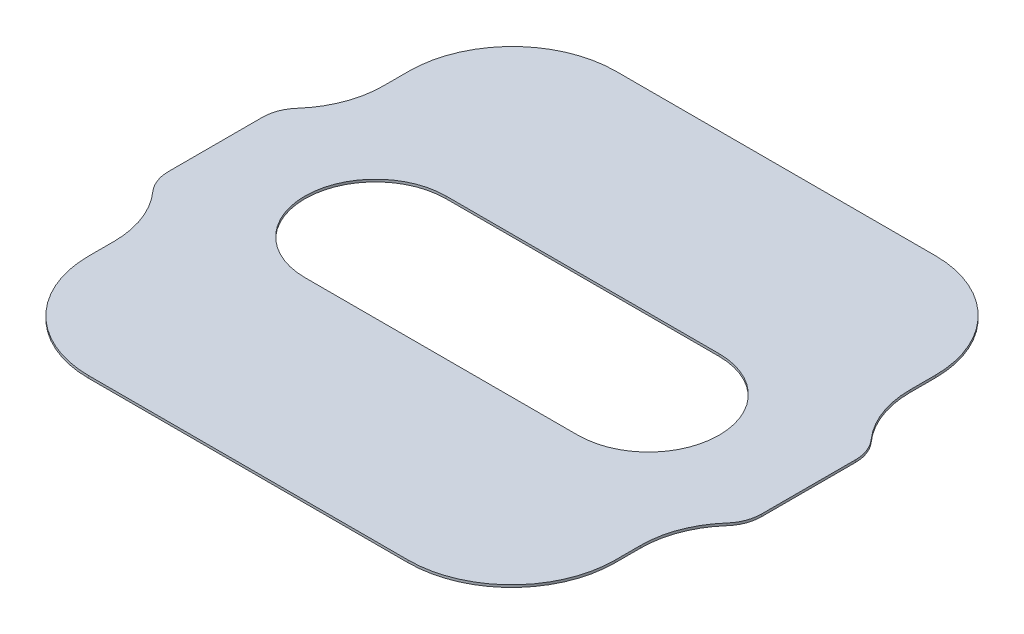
ISO-10303-21;
HEADER;
FILE_DESCRIPTION(('STEP AP214'),'2;1');
FILE_NAME('part.step','',(''),(''),'','','');
FILE_SCHEMA(('AUTOMOTIVE_DESIGN { 1 0 10303 214 1 1 1 1 }'));
ENDSEC;
DATA;
#1=APPLICATION_CONTEXT('core data for automotive mechanical design processes');
#2=APPLICATION_PROTOCOL_DEFINITION('international standard','automotive_design',2000,#1);
#3=PRODUCT_CONTEXT('',#1,'mechanical');
#4=PRODUCT('Part','Part','',(#3));
#5=PRODUCT_RELATED_PRODUCT_CATEGORY('part','',(#4));
#6=PRODUCT_DEFINITION_FORMATION('','',#4);
#7=PRODUCT_DEFINITION_CONTEXT('part definition',#1,'design');
#8=PRODUCT_DEFINITION('design','',#6,#7);
#9=PRODUCT_DEFINITION_SHAPE('','',#8);
#10=(LENGTH_UNIT() NAMED_UNIT(*) SI_UNIT(.MILLI.,.METRE.));
#11=(NAMED_UNIT(*) PLANE_ANGLE_UNIT() SI_UNIT($,.RADIAN.));
#12=(NAMED_UNIT(*) SI_UNIT($,.STERADIAN.) SOLID_ANGLE_UNIT());
#13=UNCERTAINTY_MEASURE_WITH_UNIT(LENGTH_MEASURE(1.E-05),#10,'distance_accuracy_value','');
#14=(GEOMETRIC_REPRESENTATION_CONTEXT(3) GLOBAL_UNCERTAINTY_ASSIGNED_CONTEXT((#13)) GLOBAL_UNIT_ASSIGNED_CONTEXT((#10,
#11,#12)) REPRESENTATION_CONTEXT('',''));
#15=CARTESIAN_POINT('',(0.,0.,0.));
#16=DIRECTION('',(0.,0.,1.));
#17=DIRECTION('',(1.,0.,0.));
#18=AXIS2_PLACEMENT_3D('',#15,#16,#17);
#19=CARTESIAN_POINT('',(16.1952754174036,0.0254,5.33075165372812));
#20=DIRECTION('',(0.,-1.,0.));
#21=DIRECTION('',(0.,0.,-1.));
#22=AXIS2_PLACEMENT_3D('',#19,#20,#21);
#23=CYLINDRICAL_SURFACE('',#22,0.400000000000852);
#24=CARTESIAN_POINT('',(16.1952754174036,0.,5.33075165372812));
#25=DIRECTION('',(0.,1.,0.));
#26=DIRECTION('',(0.,0.,1.));
#27=AXIS2_PLACEMENT_3D('',#24,#25,#26);
#28=CIRCLE('',#27,0.400000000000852);
#29=CARTESIAN_POINT('',(15.8963417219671,0.,5.06497233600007));
#30=VERTEX_POINT('',#29);
#31=CARTESIAN_POINT('',(15.7952754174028,0.,5.33075165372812));
#32=VERTEX_POINT('',#31);
#33=EDGE_CURVE('E230',#30,#32,#28,.T.);
#34=ORIENTED_EDGE('',*,*,#33,.T.);
#35=DIRECTION('',(0.,-1.,0.));
#36=VECTOR('',#35,1.);
#37=CARTESIAN_POINT('',(15.7952754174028,0.0254,5.33075165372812));
#38=LINE('',#37,#36);
#39=CARTESIAN_POINT('',(15.7952754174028,0.0254,5.33075165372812));
#40=VERTEX_POINT('',#39);
#41=EDGE_CURVE('E11',#40,#32,#38,.T.);
#42=ORIENTED_EDGE('',*,*,#41,.F.);
#43=CARTESIAN_POINT('',(16.1952754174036,0.0254,5.33075165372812));
#44=DIRECTION('',(0.,1.,0.));
#45=DIRECTION('',(0.,0.,1.));
#46=AXIS2_PLACEMENT_3D('',#43,#44,#45);
#47=CIRCLE('',#46,0.400000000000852);
#48=CARTESIAN_POINT('',(15.8963417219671,0.0254,5.06497233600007));
#49=VERTEX_POINT('',#48);
#50=EDGE_CURVE('E234',#49,#40,#47,.T.);
#51=ORIENTED_EDGE('',*,*,#50,.F.);
#52=DIRECTION('',(0.,-1.,0.));
#53=VECTOR('',#52,1.);
#54=CARTESIAN_POINT('',(15.8963417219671,0.0254,5.06497233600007));
#55=LINE('',#54,#53);
#56=EDGE_CURVE('E276',#49,#30,#55,.T.);
#57=ORIENTED_EDGE('',*,*,#56,.T.);
#58=EDGE_LOOP('',(#34,#42,#51,#57));
#59=FACE_BOUND('',#58,.T.);
#60=ADVANCED_FACE('F37',(#59),#23,.T.);
#61=CARTESIAN_POINT('',(15.7952754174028,0.0254,5.33075165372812));
#62=DIRECTION('',(1.,0.,0.));
#63=DIRECTION('',(0.,0.,-1.));
#64=AXIS2_PLACEMENT_3D('',#61,#62,#63);
#65=PLANE('',#64);
#66=DIRECTION('',(0.,0.,1.));
#67=VECTOR('',#66,1.);
#68=CARTESIAN_POINT('',(15.7952754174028,0.,5.33075165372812));
#69=LINE('',#68,#67);
#70=CARTESIAN_POINT('',(15.7952754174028,0.,6.33075165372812));
#71=VERTEX_POINT('',#70);
#72=EDGE_CURVE('E279',#32,#71,#69,.T.);
#73=ORIENTED_EDGE('',*,*,#72,.T.);
#74=DIRECTION('',(0.,-1.,0.));
#75=VECTOR('',#74,1.);
#76=CARTESIAN_POINT('',(15.7952754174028,0.0254,6.33075165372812));
#77=LINE('',#76,#75);
#78=CARTESIAN_POINT('',(15.7952754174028,0.0254,6.33075165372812));
#79=VERTEX_POINT('',#78);
#80=EDGE_CURVE('E44',#79,#71,#77,.T.);
#81=ORIENTED_EDGE('',*,*,#80,.F.);
#82=DIRECTION('',(0.,0.,1.));
#83=VECTOR('',#82,1.);
#84=CARTESIAN_POINT('',(15.7952754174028,0.0254,5.33075165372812));
#85=LINE('',#84,#83);
#86=EDGE_CURVE('E237',#40,#79,#85,.T.);
#87=ORIENTED_EDGE('',*,*,#86,.F.);
#88=ORIENTED_EDGE('',*,*,#41,.T.);
#89=EDGE_LOOP('',(#73,#81,#87,#88));
#90=FACE_BOUND('',#89,.T.);
#91=ADVANCED_FACE('F394',(#90),#65,.F.);
#92=CARTESIAN_POINT('',(16.1952754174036,0.0254,6.33075165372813));
#93=DIRECTION('',(0.,-1.,0.));
#94=DIRECTION('',(0.,0.,-1.));
#95=AXIS2_PLACEMENT_3D('',#92,#93,#94);
#96=CYLINDRICAL_SURFACE('',#95,0.400000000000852);
#97=CARTESIAN_POINT('',(16.1952754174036,0.,6.33075165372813));
#98=DIRECTION('',(0.,1.,0.));
#99=DIRECTION('',(0.,0.,-1.));
#100=AXIS2_PLACEMENT_3D('',#97,#98,#99);
#101=CIRCLE('',#100,0.400000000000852);
#102=CARTESIAN_POINT('',(15.8963417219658,0.,6.59653097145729));
#103=VERTEX_POINT('',#102);
#104=EDGE_CURVE('E281',#71,#103,#101,.T.);
#105=ORIENTED_EDGE('',*,*,#104,.T.);
#106=DIRECTION('',(0.,-1.,0.));
#107=VECTOR('',#106,1.);
#108=CARTESIAN_POINT('',(15.8963417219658,0.0254,6.59653097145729));
#109=LINE('',#108,#107);
#110=CARTESIAN_POINT('',(15.8963417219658,0.0254,6.59653097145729));
#111=VERTEX_POINT('',#110);
#112=EDGE_CURVE('E366',#111,#103,#109,.T.);
#113=ORIENTED_EDGE('',*,*,#112,.F.);
#114=CARTESIAN_POINT('',(16.1952754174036,0.0254,6.33075165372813));
#115=DIRECTION('',(0.,1.,0.));
#116=DIRECTION('',(0.,0.,-1.));
#117=AXIS2_PLACEMENT_3D('',#114,#115,#116);
#118=CIRCLE('',#117,0.400000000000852);
#119=EDGE_CURVE('E240',#79,#111,#118,.T.);
#120=ORIENTED_EDGE('',*,*,#119,.F.);
#121=ORIENTED_EDGE('',*,*,#80,.T.);
#122=EDGE_LOOP('',(#105,#113,#120,#121));
#123=FACE_BOUND('',#122,.T.);
#124=ADVANCED_FACE('F373',(#123),#96,.T.);
#125=CARTESIAN_POINT('',(15.149007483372,0.0254,7.2609792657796));
#126=DIRECTION('',(0.,-1.,0.));
#127=DIRECTION('',(0.,0.,-1.));
#128=AXIS2_PLACEMENT_3D('',#125,#126,#127);
#129=CYLINDRICAL_SURFACE('',#128,1.00000000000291);
#130=CARTESIAN_POINT('',(15.149007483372,0.,7.2609792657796));
#131=DIRECTION('',(0.,-1.,0.));
#132=DIRECTION('',(0.,0.,1.));
#133=AXIS2_PLACEMENT_3D('',#130,#131,#132);
#134=CIRCLE('',#133,1.00000000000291);
#135=CARTESIAN_POINT('',(16.1490074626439,0.,7.26077564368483));
#136=VERTEX_POINT('',#135);
#137=EDGE_CURVE('E283',#103,#136,#134,.T.);
#138=ORIENTED_EDGE('',*,*,#137,.T.);
#139=DIRECTION('',(0.,-1.,0.));
#140=VECTOR('',#139,1.);
#141=CARTESIAN_POINT('',(16.1490074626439,0.0254,7.26077564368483));
#142=LINE('',#141,#140);
#143=CARTESIAN_POINT('',(16.1490074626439,0.0254,7.26077564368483));
#144=VERTEX_POINT('',#143);
#145=EDGE_CURVE('E363',#144,#136,#142,.T.);
#146=ORIENTED_EDGE('',*,*,#145,.F.);
#147=CARTESIAN_POINT('',(15.149007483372,0.0254,7.2609792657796));
#148=DIRECTION('',(0.,-1.,0.));
#149=DIRECTION('',(0.,0.,1.));
#150=AXIS2_PLACEMENT_3D('',#147,#148,#149);
#151=CIRCLE('',#150,1.00000000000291);
#152=EDGE_CURVE('E242',#111,#144,#151,.T.);
#153=ORIENTED_EDGE('',*,*,#152,.F.);
#154=ORIENTED_EDGE('',*,*,#112,.T.);
#155=EDGE_LOOP('',(#138,#146,#153,#154));
#156=FACE_BOUND('',#155,.T.);
#157=ADVANCED_FACE('F382',(#156),#129,.F.);
#158=CARTESIAN_POINT('',(16.1490624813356,0.0254,7.53097563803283));
#159=DIRECTION('',(0.999999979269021,0.,-0.00020362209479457));
#160=DIRECTION('',(-0.00020362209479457,0.,-0.999999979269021));
#161=AXIS2_PLACEMENT_3D('',#158,#159,#160);
#162=PLANE('',#161);
#163=DIRECTION('',(0.00020362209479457,0.,0.999999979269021));
#164=VECTOR('',#163,1.);
#165=CARTESIAN_POINT('',(16.1490624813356,0.,7.53097563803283));
#166=LINE('',#165,#164);
#167=CARTESIAN_POINT('',(16.1490624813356,0.,7.53097563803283));
#168=VERTEX_POINT('',#167);
#169=EDGE_CURVE('E285',#136,#168,#166,.T.);
#170=ORIENTED_EDGE('',*,*,#169,.T.);
#171=DIRECTION('',(0.,-1.,0.));
#172=VECTOR('',#171,1.);
#173=CARTESIAN_POINT('',(16.1490624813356,0.0254,7.53097563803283));
#174=LINE('',#173,#172);
#175=CARTESIAN_POINT('',(16.1490624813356,0.0254,7.53097563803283));
#176=VERTEX_POINT('',#175);
#177=EDGE_CURVE('E360',#176,#168,#174,.T.);
#178=ORIENTED_EDGE('',*,*,#177,.F.);
#179=DIRECTION('',(0.00020362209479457,0.,0.999999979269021));
#180=VECTOR('',#179,1.);
#181=CARTESIAN_POINT('',(16.1490624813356,0.0254,7.53097563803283));
#182=LINE('',#181,#180);
#183=EDGE_CURVE('E244',#144,#176,#182,.T.);
#184=ORIENTED_EDGE('',*,*,#183,.F.);
#185=ORIENTED_EDGE('',*,*,#145,.T.);
#186=EDGE_LOOP('',(#170,#178,#184,#185));
#187=FACE_BOUND('',#186,.T.);
#188=ADVANCED_FACE('F386',(#187),#162,.F.);
#189=CARTESIAN_POINT('',(17.2490624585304,0.0254,7.53075165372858));
#190=DIRECTION('',(0.,-1.,0.));
#191=DIRECTION('',(0.,0.,-1.));
#192=AXIS2_PLACEMENT_3D('',#189,#190,#191);
#193=CYLINDRICAL_SURFACE('',#192,1.10000000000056);
#194=CARTESIAN_POINT('',(17.2490624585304,0.,7.53075165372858));
#195=DIRECTION('',(0.,1.,0.));
#196=DIRECTION('',(0.,0.,-1.));
#197=AXIS2_PLACEMENT_3D('',#194,#195,#196);
#198=CIRCLE('',#197,1.10000000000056);
#199=CARTESIAN_POINT('',(17.2490624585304,0.,8.63075165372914));
#200=VERTEX_POINT('',#199);
#201=EDGE_CURVE('E287',#168,#200,#198,.T.);
#202=ORIENTED_EDGE('',*,*,#201,.T.);
#203=DIRECTION('',(0.,-1.,0.));
#204=VECTOR('',#203,1.);
#205=CARTESIAN_POINT('',(17.2490624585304,0.0254,8.63075165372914));
#206=LINE('',#205,#204);
#207=CARTESIAN_POINT('',(17.2490624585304,0.0254,8.63075165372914));
#208=VERTEX_POINT('',#207);
#209=EDGE_CURVE('E357',#208,#200,#206,.T.);
#210=ORIENTED_EDGE('',*,*,#209,.F.);
#211=CARTESIAN_POINT('',(17.2490624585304,0.0254,7.53075165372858));
#212=DIRECTION('',(0.,1.,0.));
#213=DIRECTION('',(0.,0.,-1.));
#214=AXIS2_PLACEMENT_3D('',#211,#212,#213);
#215=CIRCLE('',#214,1.10000000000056);
#216=EDGE_CURVE('E246',#176,#208,#215,.T.);
#217=ORIENTED_EDGE('',*,*,#216,.F.);
#218=ORIENTED_EDGE('',*,*,#177,.T.);
#219=EDGE_LOOP('',(#202,#210,#217,#218));
#220=FACE_BOUND('',#219,.T.);
#221=ADVANCED_FACE('F467',(#220),#193,.T.);
#222=CARTESIAN_POINT('',(20.6414883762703,0.0254,8.63075165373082));
#223=DIRECTION('',(0.,0.,-1.));
#224=DIRECTION('',(-1.,0.,0.));
#225=AXIS2_PLACEMENT_3D('',#222,#223,#224);
#226=PLANE('',#225);
#227=DIRECTION('',(1.,0.,0.));
#228=VECTOR('',#227,1.);
#229=CARTESIAN_POINT('',(20.6414883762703,0.,8.63075165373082));
#230=LINE('',#229,#228);
#231=CARTESIAN_POINT('',(20.6414883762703,0.,8.63075165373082));
#232=VERTEX_POINT('',#231);
#233=EDGE_CURVE('E289',#200,#232,#230,.T.);
#234=ORIENTED_EDGE('',*,*,#233,.T.);
#235=DIRECTION('',(0.,-1.,0.));
#236=VECTOR('',#235,1.);
#237=CARTESIAN_POINT('',(20.6414883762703,0.0254,8.63075165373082));
#238=LINE('',#237,#236);
#239=CARTESIAN_POINT('',(20.6414883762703,0.0254,8.63075165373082));
#240=VERTEX_POINT('',#239);
#241=EDGE_CURVE('E354',#240,#232,#238,.T.);
#242=ORIENTED_EDGE('',*,*,#241,.F.);
#243=DIRECTION('',(1.,0.,0.));
#244=VECTOR('',#243,1.);
#245=CARTESIAN_POINT('',(20.6414883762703,0.0254,8.63075165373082));
#246=LINE('',#245,#244);
#247=EDGE_CURVE('E248',#208,#240,#246,.T.);
#248=ORIENTED_EDGE('',*,*,#247,.F.);
#249=ORIENTED_EDGE('',*,*,#209,.T.);
#250=EDGE_LOOP('',(#234,#242,#248,#249));
#251=FACE_BOUND('',#250,.T.);
#252=ADVANCED_FACE('F465',(#251),#226,.F.);
#253=CARTESIAN_POINT('',(20.6414883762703,0.0254,7.53075165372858));
#254=DIRECTION('',(0.,-1.,0.));
#255=DIRECTION('',(0.,0.,-1.));
#256=AXIS2_PLACEMENT_3D('',#253,#254,#255);
#257=CYLINDRICAL_SURFACE('',#256,1.10000000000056);
#258=CARTESIAN_POINT('',(20.6414883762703,0.,7.53075165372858));
#259=DIRECTION('',(0.,1.,0.));
#260=DIRECTION('',(0.,0.,1.));
#261=AXIS2_PLACEMENT_3D('',#258,#259,#260);
#262=CIRCLE('',#261,1.10000000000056);
#263=CARTESIAN_POINT('',(21.7414883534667,0.,7.53097563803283));
#264=VERTEX_POINT('',#263);
#265=EDGE_CURVE('E291',#232,#264,#262,.T.);
#266=ORIENTED_EDGE('',*,*,#265,.T.);
#267=DIRECTION('',(0.,-1.,0.));
#268=VECTOR('',#267,1.);
#269=CARTESIAN_POINT('',(21.7414883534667,0.0254,7.53097563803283));
#270=LINE('',#269,#268);
#271=CARTESIAN_POINT('',(21.7414883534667,0.0254,7.53097563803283));
#272=VERTEX_POINT('',#271);
#273=EDGE_CURVE('E351',#272,#264,#270,.T.);
#274=ORIENTED_EDGE('',*,*,#273,.F.);
#275=CARTESIAN_POINT('',(20.6414883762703,0.0254,7.53075165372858));
#276=DIRECTION('',(0.,1.,0.));
#277=DIRECTION('',(0.,0.,1.));
#278=AXIS2_PLACEMENT_3D('',#275,#276,#277);
#279=CIRCLE('',#278,1.10000000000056);
#280=EDGE_CURVE('E250',#240,#272,#279,.T.);
#281=ORIENTED_EDGE('',*,*,#280,.F.);
#282=ORIENTED_EDGE('',*,*,#241,.T.);
#283=EDGE_LOOP('',(#266,#274,#281,#282));
#284=FACE_BOUND('',#283,.T.);
#285=ADVANCED_FACE('F460',(#284),#257,.T.);
#286=CARTESIAN_POINT('',(21.7414883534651,0.0254,7.53097563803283));
#287=DIRECTION('',(-0.999999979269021,0.,-0.00020362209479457));
#288=DIRECTION('',(-0.00020362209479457,0.,0.999999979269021));
#289=AXIS2_PLACEMENT_3D('',#286,#287,#288);
#290=PLANE('',#289);
#291=DIRECTION('',(0.00020362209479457,0.,-0.999999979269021));
#292=VECTOR('',#291,1.);
#293=CARTESIAN_POINT('',(21.7414883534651,0.,7.53097563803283));
#294=LINE('',#293,#292);
#295=CARTESIAN_POINT('',(21.7415433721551,0.,7.26077564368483));
#296=VERTEX_POINT('',#295);
#297=EDGE_CURVE('E293',#264,#296,#294,.T.);
#298=ORIENTED_EDGE('',*,*,#297,.T.);
#299=DIRECTION('',(0.,-1.,0.));
#300=VECTOR('',#299,1.);
#301=CARTESIAN_POINT('',(21.7415433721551,0.0254,7.26077564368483));
#302=LINE('',#301,#300);
#303=CARTESIAN_POINT('',(21.7415433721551,0.0254,7.26077564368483));
#304=VERTEX_POINT('',#303);
#305=EDGE_CURVE('E348',#304,#296,#302,.T.);
#306=ORIENTED_EDGE('',*,*,#305,.F.);
#307=DIRECTION('',(0.00020362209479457,0.,-0.999999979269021));
#308=VECTOR('',#307,1.);
#309=CARTESIAN_POINT('',(21.7414883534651,0.0254,7.53097563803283));
#310=LINE('',#309,#308);
#311=EDGE_CURVE('E252',#272,#304,#310,.T.);
#312=ORIENTED_EDGE('',*,*,#311,.F.);
#313=ORIENTED_EDGE('',*,*,#273,.T.);
#314=EDGE_LOOP('',(#298,#306,#312,#313));
#315=FACE_BOUND('',#314,.T.);
#316=ADVANCED_FACE('F455',(#315),#290,.F.);
#317=CARTESIAN_POINT('',(22.7415433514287,0.0254,7.2609792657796));
#318=DIRECTION('',(0.,-1.,0.));
#319=DIRECTION('',(0.,0.,-1.));
#320=AXIS2_PLACEMENT_3D('',#317,#318,#319);
#321=CYLINDRICAL_SURFACE('',#320,1.00000000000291);
#322=CARTESIAN_POINT('',(22.7415433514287,0.,7.2609792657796));
#323=DIRECTION('',(0.,-1.,0.));
#324=DIRECTION('',(0.,0.,-1.));
#325=AXIS2_PLACEMENT_3D('',#322,#323,#324);
#326=CIRCLE('',#325,1.00000000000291);
#327=CARTESIAN_POINT('',(21.9942091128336,0.,6.59653097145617));
#328=VERTEX_POINT('',#327);
#329=EDGE_CURVE('E295',#296,#328,#326,.T.);
#330=ORIENTED_EDGE('',*,*,#329,.T.);
#331=DIRECTION('',(0.,-1.,0.));
#332=VECTOR('',#331,1.);
#333=CARTESIAN_POINT('',(21.9942091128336,0.0254,6.59653097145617));
#334=LINE('',#333,#332);
#335=CARTESIAN_POINT('',(21.9942091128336,0.0254,6.59653097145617));
#336=VERTEX_POINT('',#335);
#337=EDGE_CURVE('E345',#336,#328,#334,.T.);
#338=ORIENTED_EDGE('',*,*,#337,.F.);
#339=CARTESIAN_POINT('',(22.7415433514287,0.0254,7.2609792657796));
#340=DIRECTION('',(0.,-1.,0.));
#341=DIRECTION('',(0.,0.,-1.));
#342=AXIS2_PLACEMENT_3D('',#339,#340,#341);
#343=CIRCLE('',#342,1.00000000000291);
#344=EDGE_CURVE('E254',#304,#336,#343,.T.);
#345=ORIENTED_EDGE('',*,*,#344,.F.);
#346=ORIENTED_EDGE('',*,*,#305,.T.);
#347=EDGE_LOOP('',(#330,#338,#345,#346));
#348=FACE_BOUND('',#347,.T.);
#349=ADVANCED_FACE('F451',(#348),#321,.F.);
#350=CARTESIAN_POINT('',(21.695275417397,0.0254,6.33075165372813));
#351=DIRECTION('',(0.,-1.,0.));
#352=DIRECTION('',(0.,0.,-1.));
#353=AXIS2_PLACEMENT_3D('',#350,#351,#352);
#354=CYLINDRICAL_SURFACE('',#353,0.400000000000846);
#355=CARTESIAN_POINT('',(21.695275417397,0.,6.33075165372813));
#356=DIRECTION('',(0.,1.,0.));
#357=DIRECTION('',(0.,0.,1.));
#358=AXIS2_PLACEMENT_3D('',#355,#356,#357);
#359=CIRCLE('',#358,0.400000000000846);
#360=CARTESIAN_POINT('',(22.0952754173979,0.,6.33075165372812));
#361=VERTEX_POINT('',#360);
#362=EDGE_CURVE('E297',#328,#361,#359,.T.);
#363=ORIENTED_EDGE('',*,*,#362,.T.);
#364=DIRECTION('',(0.,-1.,0.));
#365=VECTOR('',#364,1.);
#366=CARTESIAN_POINT('',(22.0952754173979,0.0254,6.33075165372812));
#367=LINE('',#366,#365);
#368=CARTESIAN_POINT('',(22.0952754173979,0.0254,6.33075165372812));
#369=VERTEX_POINT('',#368);
#370=EDGE_CURVE('E342',#369,#361,#367,.T.);
#371=ORIENTED_EDGE('',*,*,#370,.F.);
#372=CARTESIAN_POINT('',(21.695275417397,0.0254,6.33075165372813));
#373=DIRECTION('',(0.,1.,0.));
#374=DIRECTION('',(0.,0.,1.));
#375=AXIS2_PLACEMENT_3D('',#372,#373,#374);
#376=CIRCLE('',#375,0.400000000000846);
#377=EDGE_CURVE('E256',#336,#369,#376,.T.);
#378=ORIENTED_EDGE('',*,*,#377,.F.);
#379=ORIENTED_EDGE('',*,*,#337,.T.);
#380=EDGE_LOOP('',(#363,#371,#378,#379));
#381=FACE_BOUND('',#380,.T.);
#382=ADVANCED_FACE('F446',(#381),#354,.T.);
#383=CARTESIAN_POINT('',(22.0952754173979,0.0254,5.33075165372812));
#384=DIRECTION('',(-1.,0.,0.));
#385=DIRECTION('',(0.,0.,1.));
#386=AXIS2_PLACEMENT_3D('',#383,#384,#385);
#387=PLANE('',#386);
#388=DIRECTION('',(0.,0.,-1.));
#389=VECTOR('',#388,1.);
#390=CARTESIAN_POINT('',(22.0952754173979,0.,5.33075165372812));
#391=LINE('',#390,#389);
#392=CARTESIAN_POINT('',(22.0952754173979,0.,5.33075165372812));
#393=VERTEX_POINT('',#392);
#394=EDGE_CURVE('E299',#361,#393,#391,.T.);
#395=ORIENTED_EDGE('',*,*,#394,.T.);
#396=DIRECTION('',(0.,-1.,0.));
#397=VECTOR('',#396,1.);
#398=CARTESIAN_POINT('',(22.0952754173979,0.0254,5.33075165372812));
#399=LINE('',#398,#397);
#400=CARTESIAN_POINT('',(22.0952754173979,0.0254,5.33075165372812));
#401=VERTEX_POINT('',#400);
#402=EDGE_CURVE('E339',#401,#393,#399,.T.);
#403=ORIENTED_EDGE('',*,*,#402,.F.);
#404=DIRECTION('',(0.,0.,-1.));
#405=VECTOR('',#404,1.);
#406=CARTESIAN_POINT('',(22.0952754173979,0.0254,5.33075165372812));
#407=LINE('',#406,#405);
#408=EDGE_CURVE('E258',#369,#401,#407,.T.);
#409=ORIENTED_EDGE('',*,*,#408,.F.);
#410=ORIENTED_EDGE('',*,*,#370,.T.);
#411=EDGE_LOOP('',(#395,#403,#409,#410));
#412=FACE_BOUND('',#411,.T.);
#413=ADVANCED_FACE('F440',(#412),#387,.F.);
#414=CARTESIAN_POINT('',(21.695275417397,0.0254,5.33075165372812));
#415=DIRECTION('',(0.,-1.,0.));
#416=DIRECTION('',(0.,0.,-1.));
#417=AXIS2_PLACEMENT_3D('',#414,#415,#416);
#418=CYLINDRICAL_SURFACE('',#417,0.400000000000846);
#419=CARTESIAN_POINT('',(21.695275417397,0.,5.33075165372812));
#420=DIRECTION('',(0.,1.,0.));
#421=DIRECTION('',(0.,0.,-1.));
#422=AXIS2_PLACEMENT_3D('',#419,#420,#421);
#423=CIRCLE('',#422,0.400000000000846);
#424=CARTESIAN_POINT('',(21.9942091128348,0.,5.06497233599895));
#425=VERTEX_POINT('',#424);
#426=EDGE_CURVE('E301',#393,#425,#423,.T.);
#427=ORIENTED_EDGE('',*,*,#426,.T.);
#428=DIRECTION('',(0.,-1.,0.));
#429=VECTOR('',#428,1.);
#430=CARTESIAN_POINT('',(21.9942091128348,0.0254,5.06497233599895));
#431=LINE('',#430,#429);
#432=CARTESIAN_POINT('',(21.9942091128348,0.0254,5.06497233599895));
#433=VERTEX_POINT('',#432);
#434=EDGE_CURVE('E336',#433,#425,#431,.T.);
#435=ORIENTED_EDGE('',*,*,#434,.F.);
#436=CARTESIAN_POINT('',(21.695275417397,0.0254,5.33075165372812));
#437=DIRECTION('',(0.,1.,0.));
#438=DIRECTION('',(0.,0.,-1.));
#439=AXIS2_PLACEMENT_3D('',#436,#437,#438);
#440=CIRCLE('',#439,0.400000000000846);
#441=EDGE_CURVE('E260',#401,#433,#440,.T.);
#442=ORIENTED_EDGE('',*,*,#441,.F.);
#443=ORIENTED_EDGE('',*,*,#402,.T.);
#444=EDGE_LOOP('',(#427,#435,#442,#443));
#445=FACE_BOUND('',#444,.T.);
#446=ADVANCED_FACE('F436',(#445),#418,.T.);
#447=CARTESIAN_POINT('',(22.7415433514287,0.0254,4.40052404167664));
#448=DIRECTION('',(0.,-1.,0.));
#449=DIRECTION('',(0.,0.,-1.));
#450=AXIS2_PLACEMENT_3D('',#447,#448,#449);
#451=CYLINDRICAL_SURFACE('',#450,1.00000000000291);
#452=CARTESIAN_POINT('',(22.7415433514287,0.,4.40052404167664));
#453=DIRECTION('',(0.,-1.,0.));
#454=DIRECTION('',(0.,0.,1.));
#455=AXIS2_PLACEMENT_3D('',#452,#453,#454);
#456=CIRCLE('',#455,1.00000000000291);
#457=CARTESIAN_POINT('',(21.7415433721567,0.,4.40072766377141));
#458=VERTEX_POINT('',#457);
#459=EDGE_CURVE('E303',#425,#458,#456,.T.);
#460=ORIENTED_EDGE('',*,*,#459,.T.);
#461=DIRECTION('',(0.,-1.,0.));
#462=VECTOR('',#461,1.);
#463=CARTESIAN_POINT('',(21.7415433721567,0.0254,4.40072766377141));
#464=LINE('',#463,#462);
#465=CARTESIAN_POINT('',(21.7415433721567,0.0254,4.40072766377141));
#466=VERTEX_POINT('',#465);
#467=EDGE_CURVE('E333',#466,#458,#464,.T.);
#468=ORIENTED_EDGE('',*,*,#467,.F.);
#469=CARTESIAN_POINT('',(22.7415433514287,0.0254,4.40052404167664));
#470=DIRECTION('',(0.,-1.,0.));
#471=DIRECTION('',(0.,0.,1.));
#472=AXIS2_PLACEMENT_3D('',#469,#470,#471);
#473=CIRCLE('',#472,1.00000000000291);
#474=EDGE_CURVE('E262',#433,#466,#473,.T.);
#475=ORIENTED_EDGE('',*,*,#474,.F.);
#476=ORIENTED_EDGE('',*,*,#434,.T.);
#477=EDGE_LOOP('',(#460,#468,#475,#476));
#478=FACE_BOUND('',#477,.T.);
#479=ADVANCED_FACE('F431',(#478),#451,.F.);
#480=CARTESIAN_POINT('',(21.7414883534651,0.0254,4.13052766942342));
#481=DIRECTION('',(-0.999999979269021,0.,0.00020362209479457));
#482=DIRECTION('',(0.00020362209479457,0.,0.999999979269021));
#483=AXIS2_PLACEMENT_3D('',#480,#481,#482);
#484=PLANE('',#483);
#485=DIRECTION('',(-0.00020362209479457,0.,-0.999999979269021));
#486=VECTOR('',#485,1.);
#487=CARTESIAN_POINT('',(21.7414883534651,0.,4.13052766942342));
#488=LINE('',#487,#486);
#489=CARTESIAN_POINT('',(21.7414883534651,0.,4.13052766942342));
#490=VERTEX_POINT('',#489);
#491=EDGE_CURVE('E305',#458,#490,#488,.T.);
#492=ORIENTED_EDGE('',*,*,#491,.T.);
#493=DIRECTION('',(0.,-1.,0.));
#494=VECTOR('',#493,1.);
#495=CARTESIAN_POINT('',(21.7414883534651,0.0254,4.13052766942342));
#496=LINE('',#495,#494);
#497=CARTESIAN_POINT('',(21.7414883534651,0.0254,4.13052766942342));
#498=VERTEX_POINT('',#497);
#499=EDGE_CURVE('E330',#498,#490,#496,.T.);
#500=ORIENTED_EDGE('',*,*,#499,.F.);
#501=DIRECTION('',(-0.00020362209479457,0.,-0.999999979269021));
#502=VECTOR('',#501,1.);
#503=CARTESIAN_POINT('',(21.7414883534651,0.0254,4.13052766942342));
#504=LINE('',#503,#502);
#505=EDGE_CURVE('E264',#466,#498,#504,.T.);
#506=ORIENTED_EDGE('',*,*,#505,.F.);
#507=ORIENTED_EDGE('',*,*,#467,.T.);
#508=EDGE_LOOP('',(#492,#500,#506,#507));
#509=FACE_BOUND('',#508,.T.);
#510=ADVANCED_FACE('F425',(#509),#484,.F.);
#511=CARTESIAN_POINT('',(20.6414883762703,0.0254,4.13075165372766));
#512=DIRECTION('',(0.,-1.,0.));
#513=DIRECTION('',(0.,0.,-1.));
#514=AXIS2_PLACEMENT_3D('',#511,#512,#513);
#515=CYLINDRICAL_SURFACE('',#514,1.10000000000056);
#516=CARTESIAN_POINT('',(20.6414883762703,0.,4.13075165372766));
#517=DIRECTION('',(0.,1.,0.));
#518=DIRECTION('',(0.,0.,-1.));
#519=AXIS2_PLACEMENT_3D('',#516,#517,#518);
#520=CIRCLE('',#519,1.10000000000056);
#521=CARTESIAN_POINT('',(20.6414883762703,0.,3.0307516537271));
#522=VERTEX_POINT('',#521);
#523=EDGE_CURVE('E307',#490,#522,#520,.T.);
#524=ORIENTED_EDGE('',*,*,#523,.T.);
#525=DIRECTION('',(0.,-1.,0.));
#526=VECTOR('',#525,1.);
#527=CARTESIAN_POINT('',(20.6414883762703,0.0254,3.0307516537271));
#528=LINE('',#527,#526);
#529=CARTESIAN_POINT('',(20.6414883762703,0.0254,3.0307516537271));
#530=VERTEX_POINT('',#529);
#531=EDGE_CURVE('E327',#530,#522,#528,.T.);
#532=ORIENTED_EDGE('',*,*,#531,.F.);
#533=CARTESIAN_POINT('',(20.6414883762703,0.0254,4.13075165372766));
#534=DIRECTION('',(0.,1.,0.));
#535=DIRECTION('',(0.,0.,-1.));
#536=AXIS2_PLACEMENT_3D('',#533,#534,#535);
#537=CIRCLE('',#536,1.10000000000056);
#538=EDGE_CURVE('E266',#498,#530,#537,.T.);
#539=ORIENTED_EDGE('',*,*,#538,.F.);
#540=ORIENTED_EDGE('',*,*,#499,.T.);
#541=EDGE_LOOP('',(#524,#532,#539,#540));
#542=FACE_BOUND('',#541,.T.);
#543=ADVANCED_FACE('F421',(#542),#515,.T.);
#544=CARTESIAN_POINT('',(20.6414883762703,0.0254,3.03075165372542));
#545=DIRECTION('',(0.,0.,1.));
#546=DIRECTION('',(1.,0.,0.));
#547=AXIS2_PLACEMENT_3D('',#544,#545,#546);
#548=PLANE('',#547);
#549=DIRECTION('',(-1.,0.,0.));
#550=VECTOR('',#549,1.);
#551=CARTESIAN_POINT('',(20.6414883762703,0.,3.03075165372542));
#552=LINE('',#551,#550);
#553=CARTESIAN_POINT('',(17.2490624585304,0.,3.03075165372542));
#554=VERTEX_POINT('',#553);
#555=EDGE_CURVE('E309',#522,#554,#552,.T.);
#556=ORIENTED_EDGE('',*,*,#555,.T.);
#557=DIRECTION('',(0.,-1.,0.));
#558=VECTOR('',#557,1.);
#559=CARTESIAN_POINT('',(17.2490624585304,0.0254,3.03075165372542));
#560=LINE('',#559,#558);
#561=CARTESIAN_POINT('',(17.2490624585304,0.0254,3.03075165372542));
#562=VERTEX_POINT('',#561);
#563=EDGE_CURVE('E324',#562,#554,#560,.T.);
#564=ORIENTED_EDGE('',*,*,#563,.F.);
#565=DIRECTION('',(-1.,0.,0.));
#566=VECTOR('',#565,1.);
#567=CARTESIAN_POINT('',(20.6414883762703,0.0254,3.03075165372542));
#568=LINE('',#567,#566);
#569=EDGE_CURVE('E268',#530,#562,#568,.T.);
#570=ORIENTED_EDGE('',*,*,#569,.F.);
#571=ORIENTED_EDGE('',*,*,#531,.T.);
#572=EDGE_LOOP('',(#556,#564,#570,#571));
#573=FACE_BOUND('',#572,.T.);
#574=ADVANCED_FACE('F416',(#573),#548,.F.);
#575=CARTESIAN_POINT('',(17.2490624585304,0.0254,4.13075165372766));
#576=DIRECTION('',(0.,-1.,0.));
#577=DIRECTION('',(0.,0.,-1.));
#578=AXIS2_PLACEMENT_3D('',#575,#576,#577);
#579=CYLINDRICAL_SURFACE('',#578,1.10000000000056);
#580=CARTESIAN_POINT('',(17.2490624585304,0.,4.13075165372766));
#581=DIRECTION('',(0.,1.,0.));
#582=DIRECTION('',(0.,0.,1.));
#583=AXIS2_PLACEMENT_3D('',#580,#581,#582);
#584=CIRCLE('',#583,1.10000000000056);
#585=CARTESIAN_POINT('',(16.1490624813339,0.,4.13052766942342));
#586=VERTEX_POINT('',#585);
#587=EDGE_CURVE('E311',#554,#586,#584,.T.);
#588=ORIENTED_EDGE('',*,*,#587,.T.);
#589=DIRECTION('',(0.,-1.,0.));
#590=VECTOR('',#589,1.);
#591=CARTESIAN_POINT('',(16.1490624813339,0.0254,4.13052766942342));
#592=LINE('',#591,#590);
#593=CARTESIAN_POINT('',(16.1490624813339,0.0254,4.13052766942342));
#594=VERTEX_POINT('',#593);
#595=EDGE_CURVE('E321',#594,#586,#592,.T.);
#596=ORIENTED_EDGE('',*,*,#595,.F.);
#597=CARTESIAN_POINT('',(17.2490624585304,0.0254,4.13075165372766));
#598=DIRECTION('',(0.,1.,0.));
#599=DIRECTION('',(0.,0.,1.));
#600=AXIS2_PLACEMENT_3D('',#597,#598,#599);
#601=CIRCLE('',#600,1.10000000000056);
#602=EDGE_CURVE('E270',#562,#594,#601,.T.);
#603=ORIENTED_EDGE('',*,*,#602,.F.);
#604=ORIENTED_EDGE('',*,*,#563,.T.);
#605=EDGE_LOOP('',(#588,#596,#603,#604));
#606=FACE_BOUND('',#605,.T.);
#607=ADVANCED_FACE('F410',(#606),#579,.T.);
#608=CARTESIAN_POINT('',(16.1490624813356,0.0254,4.13052766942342));
#609=DIRECTION('',(0.999999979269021,0.,0.00020362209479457));
#610=DIRECTION('',(0.00020362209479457,0.,-0.999999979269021));
#611=AXIS2_PLACEMENT_3D('',#608,#609,#610);
#612=PLANE('',#611);
#613=DIRECTION('',(-0.00020362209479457,0.,0.999999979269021));
#614=VECTOR('',#613,1.);
#615=CARTESIAN_POINT('',(16.1490624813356,0.,4.13052766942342));
#616=LINE('',#615,#614);
#617=CARTESIAN_POINT('',(16.1490074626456,0.,4.40072766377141));
#618=VERTEX_POINT('',#617);
#619=EDGE_CURVE('E313',#586,#618,#616,.T.);
#620=ORIENTED_EDGE('',*,*,#619,.T.);
#621=DIRECTION('',(0.,-1.,0.));
#622=VECTOR('',#621,1.);
#623=CARTESIAN_POINT('',(16.1490074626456,0.0254,4.40072766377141));
#624=LINE('',#623,#622);
#625=CARTESIAN_POINT('',(16.1490074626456,0.0254,4.40072766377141));
#626=VERTEX_POINT('',#625);
#627=EDGE_CURVE('E318',#626,#618,#624,.T.);
#628=ORIENTED_EDGE('',*,*,#627,.F.);
#629=DIRECTION('',(-0.00020362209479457,0.,0.999999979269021));
#630=VECTOR('',#629,1.);
#631=CARTESIAN_POINT('',(16.1490624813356,0.0254,4.13052766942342));
#632=LINE('',#631,#630);
#633=EDGE_CURVE('E272',#594,#626,#632,.T.);
#634=ORIENTED_EDGE('',*,*,#633,.F.);
#635=ORIENTED_EDGE('',*,*,#595,.T.);
#636=EDGE_LOOP('',(#620,#628,#634,#635));
#637=FACE_BOUND('',#636,.T.);
#638=ADVANCED_FACE('F406',(#637),#612,.F.);
#639=CARTESIAN_POINT('',(15.149007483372,0.0254,4.40052404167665));
#640=DIRECTION('',(0.,-1.,0.));
#641=DIRECTION('',(0.,0.,-1.));
#642=AXIS2_PLACEMENT_3D('',#639,#640,#641);
#643=CYLINDRICAL_SURFACE('',#642,1.00000000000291);
#644=CARTESIAN_POINT('',(15.149007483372,0.,4.40052404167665));
#645=DIRECTION('',(0.,-1.,0.));
#646=DIRECTION('',(0.,0.,-1.));
#647=AXIS2_PLACEMENT_3D('',#644,#645,#646);
#648=CIRCLE('',#647,1.00000000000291);
#649=EDGE_CURVE('E238',#618,#30,#648,.T.);
#650=ORIENTED_EDGE('',*,*,#649,.T.);
#651=ORIENTED_EDGE('',*,*,#56,.F.);
#652=CARTESIAN_POINT('',(15.149007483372,0.0254,4.40052404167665));
#653=DIRECTION('',(0.,-1.,0.));
#654=DIRECTION('',(0.,0.,-1.));
#655=AXIS2_PLACEMENT_3D('',#652,#653,#654);
#656=CIRCLE('',#655,1.00000000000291);
#657=EDGE_CURVE('E274',#626,#49,#656,.T.);
#658=ORIENTED_EDGE('',*,*,#657,.F.);
#659=ORIENTED_EDGE('',*,*,#627,.T.);
#660=EDGE_LOOP('',(#650,#651,#658,#659));
#661=FACE_BOUND('',#660,.T.);
#662=ADVANCED_FACE('F401',(#661),#643,.F.);
#663=CARTESIAN_POINT('',(16.1952754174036,0.0254,5.33075165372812));
#664=DIRECTION('',(0.,1.,0.));
#665=DIRECTION('',(0.,0.,1.));
#666=AXIS2_PLACEMENT_3D('',#663,#664,#665);
#667=PLANE('',#666);
#668=CARTESIAN_POINT('',(17.4952754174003,0.0254,5.83075165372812));
#669=DIRECTION('',(0.,1.,0.));
#670=DIRECTION('',(0.,0.,1.));
#671=AXIS2_PLACEMENT_3D('',#668,#669,#670);
#672=CIRCLE('',#671,0.750000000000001);
#673=CARTESIAN_POINT('',(17.4952754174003,0.0254,5.08075165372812));
#674=VERTEX_POINT('',#673);
#675=CARTESIAN_POINT('',(17.4952754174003,0.0254,6.58075165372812));
#676=VERTEX_POINT('',#675);
#677=EDGE_CURVE('E51',#674,#676,#672,.T.);
#678=ORIENTED_EDGE('',*,*,#677,.F.);
#679=DIRECTION('',(-1.,0.,0.));
#680=VECTOR('',#679,1.);
#681=CARTESIAN_POINT('',(17.4952754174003,0.0254,5.08075165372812));
#682=LINE('',#681,#680);
#683=CARTESIAN_POINT('',(20.3952754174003,0.0254,5.08075165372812));
#684=VERTEX_POINT('',#683);
#685=EDGE_CURVE('E215',#684,#674,#682,.T.);
#686=ORIENTED_EDGE('',*,*,#685,.F.);
#687=CARTESIAN_POINT('',(20.3952754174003,0.0254,5.83075165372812));
#688=DIRECTION('',(0.,1.,0.));
#689=DIRECTION('',(0.,0.,1.));
#690=AXIS2_PLACEMENT_3D('',#687,#688,#689);
#691=CIRCLE('',#690,0.750000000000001);
#692=CARTESIAN_POINT('',(20.3952754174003,0.0254,6.58075165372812));
#693=VERTEX_POINT('',#692);
#694=EDGE_CURVE('E218',#693,#684,#691,.T.);
#695=ORIENTED_EDGE('',*,*,#694,.F.);
#696=DIRECTION('',(1.,0.,0.));
#697=VECTOR('',#696,1.);
#698=CARTESIAN_POINT('',(17.4952754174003,0.0254,6.58075165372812));
#699=LINE('',#698,#697);
#700=EDGE_CURVE('E224',#676,#693,#699,.T.);
#701=ORIENTED_EDGE('',*,*,#700,.F.);
#702=EDGE_LOOP('',(#678,#686,#695,#701));
#703=FACE_BOUND('',#702,.T.);
#704=ORIENTED_EDGE('',*,*,#50,.T.);
#705=ORIENTED_EDGE('',*,*,#86,.T.);
#706=ORIENTED_EDGE('',*,*,#119,.T.);
#707=ORIENTED_EDGE('',*,*,#152,.T.);
#708=ORIENTED_EDGE('',*,*,#183,.T.);
#709=ORIENTED_EDGE('',*,*,#216,.T.);
#710=ORIENTED_EDGE('',*,*,#247,.T.);
#711=ORIENTED_EDGE('',*,*,#280,.T.);
#712=ORIENTED_EDGE('',*,*,#311,.T.);
#713=ORIENTED_EDGE('',*,*,#344,.T.);
#714=ORIENTED_EDGE('',*,*,#377,.T.);
#715=ORIENTED_EDGE('',*,*,#408,.T.);
#716=ORIENTED_EDGE('',*,*,#441,.T.);
#717=ORIENTED_EDGE('',*,*,#474,.T.);
#718=ORIENTED_EDGE('',*,*,#505,.T.);
#719=ORIENTED_EDGE('',*,*,#538,.T.);
#720=ORIENTED_EDGE('',*,*,#569,.T.);
#721=ORIENTED_EDGE('',*,*,#602,.T.);
#722=ORIENTED_EDGE('',*,*,#633,.T.);
#723=ORIENTED_EDGE('',*,*,#657,.T.);
#724=EDGE_LOOP('',(#704,#705,#706,#707,#708,#709,#710,#711,#712,#713,#714,#715,#716,#717,#718,
#719,#720,#721,#722,#723));
#725=FACE_BOUND('',#724,.T.);
#726=ADVANCED_FACE('F390',(#703,#725),#667,.T.);
#727=CARTESIAN_POINT('',(16.1952754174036,0.,5.33075165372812));
#728=DIRECTION('',(0.,1.,0.));
#729=DIRECTION('',(0.,0.,1.));
#730=AXIS2_PLACEMENT_3D('',#727,#728,#729);
#731=PLANE('',#730);
#732=DIRECTION('',(-1.,0.,0.));
#733=VECTOR('',#732,1.);
#734=CARTESIAN_POINT('',(17.4952754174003,0.,5.08075165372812));
#735=LINE('',#734,#733);
#736=CARTESIAN_POINT('',(20.3952754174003,0.,5.08075165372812));
#737=VERTEX_POINT('',#736);
#738=CARTESIAN_POINT('',(17.4952754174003,0.,5.08075165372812));
#739=VERTEX_POINT('',#738);
#740=EDGE_CURVE('E205',#737,#739,#735,.T.);
#741=ORIENTED_EDGE('',*,*,#740,.T.);
#742=CARTESIAN_POINT('',(17.4952754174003,0.,5.83075165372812));
#743=DIRECTION('',(0.,1.,0.));
#744=DIRECTION('',(0.,0.,1.));
#745=AXIS2_PLACEMENT_3D('',#742,#743,#744);
#746=CIRCLE('',#745,0.750000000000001);
#747=CARTESIAN_POINT('',(17.4952754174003,0.,6.58075165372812));
#748=VERTEX_POINT('',#747);
#749=EDGE_CURVE('E199',#739,#748,#746,.T.);
#750=ORIENTED_EDGE('',*,*,#749,.T.);
#751=DIRECTION('',(1.,0.,0.));
#752=VECTOR('',#751,1.);
#753=CARTESIAN_POINT('',(17.4952754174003,0.,6.58075165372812));
#754=LINE('',#753,#752);
#755=CARTESIAN_POINT('',(20.3952754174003,0.,6.58075165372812));
#756=VERTEX_POINT('',#755);
#757=EDGE_CURVE('E208',#748,#756,#754,.T.);
#758=ORIENTED_EDGE('',*,*,#757,.T.);
#759=CARTESIAN_POINT('',(20.3952754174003,0.,5.83075165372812));
#760=DIRECTION('',(0.,1.,0.));
#761=DIRECTION('',(0.,0.,1.));
#762=AXIS2_PLACEMENT_3D('',#759,#760,#761);
#763=CIRCLE('',#762,0.750000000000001);
#764=EDGE_CURVE('E59',#756,#737,#763,.T.);
#765=ORIENTED_EDGE('',*,*,#764,.T.);
#766=EDGE_LOOP('',(#741,#750,#758,#765));
#767=FACE_BOUND('',#766,.T.);
#768=ORIENTED_EDGE('',*,*,#33,.F.);
#769=ORIENTED_EDGE('',*,*,#649,.F.);
#770=ORIENTED_EDGE('',*,*,#619,.F.);
#771=ORIENTED_EDGE('',*,*,#587,.F.);
#772=ORIENTED_EDGE('',*,*,#555,.F.);
#773=ORIENTED_EDGE('',*,*,#523,.F.);
#774=ORIENTED_EDGE('',*,*,#491,.F.);
#775=ORIENTED_EDGE('',*,*,#459,.F.);
#776=ORIENTED_EDGE('',*,*,#426,.F.);
#777=ORIENTED_EDGE('',*,*,#394,.F.);
#778=ORIENTED_EDGE('',*,*,#362,.F.);
#779=ORIENTED_EDGE('',*,*,#329,.F.);
#780=ORIENTED_EDGE('',*,*,#297,.F.);
#781=ORIENTED_EDGE('',*,*,#265,.F.);
#782=ORIENTED_EDGE('',*,*,#233,.F.);
#783=ORIENTED_EDGE('',*,*,#201,.F.);
#784=ORIENTED_EDGE('',*,*,#169,.F.);
#785=ORIENTED_EDGE('',*,*,#137,.F.);
#786=ORIENTED_EDGE('',*,*,#104,.F.);
#787=ORIENTED_EDGE('',*,*,#72,.F.);
#788=EDGE_LOOP('',(#768,#769,#770,#771,#772,#773,#774,#775,#776,#777,#778,#779,#780,#781,#782,
#783,#784,#785,#786,#787));
#789=FACE_BOUND('',#788,.T.);
#790=ADVANCED_FACE('F212',(#767,#789),#731,.F.);
#791=CARTESIAN_POINT('',(17.4952754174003,0.,5.83075165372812));
#792=DIRECTION('',(0.,1.,0.));
#793=DIRECTION('',(0.,0.,1.));
#794=AXIS2_PLACEMENT_3D('',#791,#792,#793);
#795=CYLINDRICAL_SURFACE('',#794,0.750000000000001);
#796=ORIENTED_EDGE('',*,*,#677,.T.);
#797=DIRECTION('',(0.,1.,0.));
#798=VECTOR('',#797,1.);
#799=CARTESIAN_POINT('',(17.4952754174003,0.,6.58075165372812));
#800=LINE('',#799,#798);
#801=EDGE_CURVE('E195',#748,#676,#800,.T.);
#802=ORIENTED_EDGE('',*,*,#801,.F.);
#803=ORIENTED_EDGE('',*,*,#749,.F.);
#804=DIRECTION('',(0.,1.,0.));
#805=VECTOR('',#804,1.);
#806=CARTESIAN_POINT('',(17.4952754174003,0.,5.08075165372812));
#807=LINE('',#806,#805);
#808=EDGE_CURVE('E228',#739,#674,#807,.T.);
#809=ORIENTED_EDGE('',*,*,#808,.T.);
#810=EDGE_LOOP('',(#796,#802,#803,#809));
#811=FACE_BOUND('',#810,.T.);
#812=ADVANCED_FACE('F197',(#811),#795,.F.);
#813=CARTESIAN_POINT('',(17.4952754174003,0.,5.08075165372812));
#814=DIRECTION('',(0.,0.,-1.));
#815=DIRECTION('',(-1.,0.,0.));
#816=AXIS2_PLACEMENT_3D('',#813,#814,#815);
#817=PLANE('',#816);
#818=ORIENTED_EDGE('',*,*,#685,.T.);
#819=ORIENTED_EDGE('',*,*,#808,.F.);
#820=ORIENTED_EDGE('',*,*,#740,.F.);
#821=DIRECTION('',(0.,1.,0.));
#822=VECTOR('',#821,1.);
#823=CARTESIAN_POINT('',(20.3952754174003,0.,5.08075165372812));
#824=LINE('',#823,#822);
#825=EDGE_CURVE('E231',#737,#684,#824,.T.);
#826=ORIENTED_EDGE('',*,*,#825,.T.);
#827=EDGE_LOOP('',(#818,#819,#820,#826));
#828=FACE_BOUND('',#827,.T.);
#829=ADVANCED_FACE('F652',(#828),#817,.F.);
#830=CARTESIAN_POINT('',(20.3952754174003,0.,5.83075165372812));
#831=DIRECTION('',(0.,1.,0.));
#832=DIRECTION('',(0.,0.,1.));
#833=AXIS2_PLACEMENT_3D('',#830,#831,#832);
#834=CYLINDRICAL_SURFACE('',#833,0.750000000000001);
#835=ORIENTED_EDGE('',*,*,#694,.T.);
#836=ORIENTED_EDGE('',*,*,#825,.F.);
#837=ORIENTED_EDGE('',*,*,#764,.F.);
#838=DIRECTION('',(0.,1.,0.));
#839=VECTOR('',#838,1.);
#840=CARTESIAN_POINT('',(20.3952754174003,0.,6.58075165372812));
#841=LINE('',#840,#839);
#842=EDGE_CURVE('E204',#756,#693,#841,.T.);
#843=ORIENTED_EDGE('',*,*,#842,.T.);
#844=EDGE_LOOP('',(#835,#836,#837,#843));
#845=FACE_BOUND('',#844,.T.);
#846=ADVANCED_FACE('F662',(#845),#834,.F.);
#847=CARTESIAN_POINT('',(17.4952754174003,0.,6.58075165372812));
#848=DIRECTION('',(0.,0.,1.));
#849=DIRECTION('',(1.,0.,0.));
#850=AXIS2_PLACEMENT_3D('',#847,#848,#849);
#851=PLANE('',#850);
#852=ORIENTED_EDGE('',*,*,#700,.T.);
#853=ORIENTED_EDGE('',*,*,#842,.F.);
#854=ORIENTED_EDGE('',*,*,#757,.F.);
#855=ORIENTED_EDGE('',*,*,#801,.T.);
#856=EDGE_LOOP('',(#852,#853,#854,#855));
#857=FACE_BOUND('',#856,.T.);
#858=ADVANCED_FACE('F209',(#857),#851,.F.);
#859=CLOSED_SHELL('',(#60,#91,#124,#157,#188,#221,#252,#285,#316,#349,#382,#413,#446,#479,#510,
#543,#574,#607,#638,#662,#726,#790,#812,#829,#846,#858));
#860=MANIFOLD_SOLID_BREP('B2',#859);
#861=ADVANCED_BREP_SHAPE_REPRESENTATION('',(#18,#860),#14);
#862=SHAPE_DEFINITION_REPRESENTATION(#9,#861);
ENDSEC;
END-ISO-10303-21;
